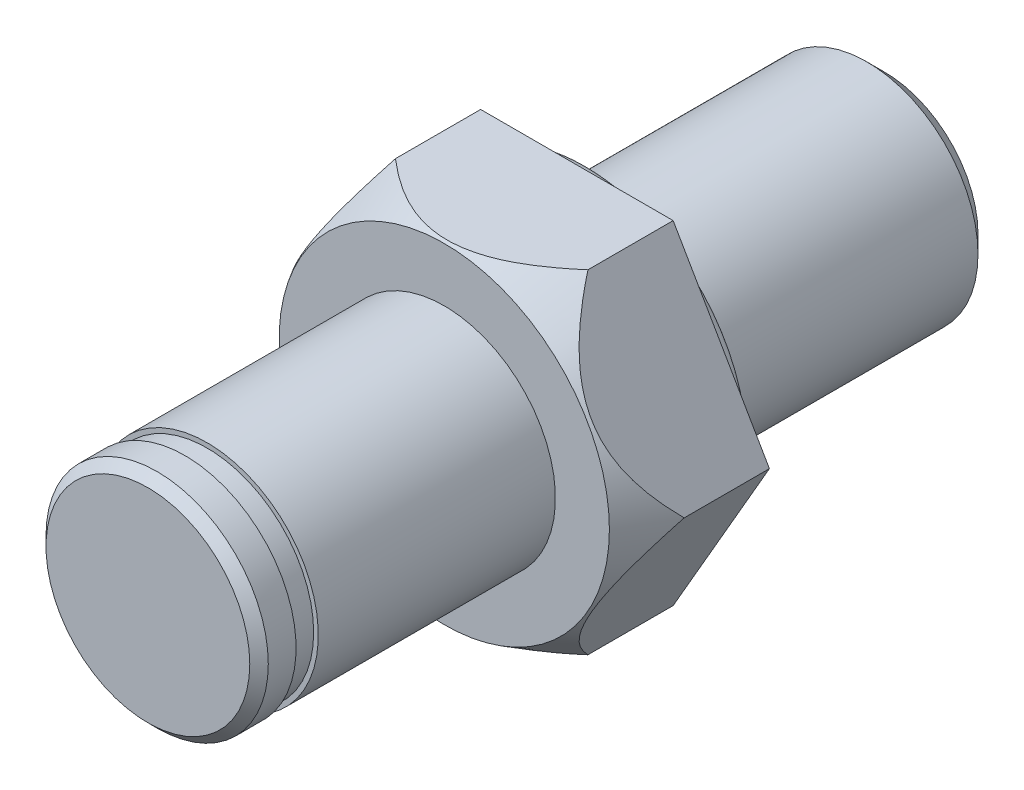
ISO-10303-21;
HEADER;
FILE_DESCRIPTION(('STEP AP214'),'2;1');
FILE_NAME('part.step','',(''),(''),'','','');
FILE_SCHEMA(('AUTOMOTIVE_DESIGN { 1 0 10303 214 1 1 1 1 }'));
ENDSEC;
DATA;
#1=APPLICATION_CONTEXT('core data for automotive mechanical design processes');
#2=APPLICATION_PROTOCOL_DEFINITION('international standard','automotive_design',2000,#1);
#3=PRODUCT_CONTEXT('',#1,'mechanical');
#4=PRODUCT('Part','Part','',(#3));
#5=PRODUCT_RELATED_PRODUCT_CATEGORY('part','',(#4));
#6=PRODUCT_DEFINITION_FORMATION('','',#4);
#7=PRODUCT_DEFINITION_CONTEXT('part definition',#1,'design');
#8=PRODUCT_DEFINITION('design','',#6,#7);
#9=PRODUCT_DEFINITION_SHAPE('','',#8);
#10=(LENGTH_UNIT() NAMED_UNIT(*) SI_UNIT(.MILLI.,.METRE.));
#11=(NAMED_UNIT(*) PLANE_ANGLE_UNIT() SI_UNIT($,.RADIAN.));
#12=(NAMED_UNIT(*) SI_UNIT($,.STERADIAN.) SOLID_ANGLE_UNIT());
#13=UNCERTAINTY_MEASURE_WITH_UNIT(LENGTH_MEASURE(1.E-05),#10,'distance_accuracy_value','');
#14=(GEOMETRIC_REPRESENTATION_CONTEXT(3) GLOBAL_UNCERTAINTY_ASSIGNED_CONTEXT((#13)) GLOBAL_UNIT_ASSIGNED_CONTEXT((#10,
#11,#12)) REPRESENTATION_CONTEXT('',''));
#15=CARTESIAN_POINT('',(0.,0.,0.));
#16=DIRECTION('',(0.,0.,1.));
#17=DIRECTION('',(1.,0.,0.));
#18=AXIS2_PLACEMENT_3D('',#15,#16,#17);
#19=CARTESIAN_POINT('',(0.,8.91428331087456,7.16));
#20=DIRECTION('',(0.,0.,-1.));
#21=DIRECTION('',(-1.,0.,0.));
#22=AXIS2_PLACEMENT_3D('',#19,#20,#21);
#23=PLANE('',#22);
#24=CARTESIAN_POINT('',(0.,0.,7.16));
#25=DIRECTION('',(0.,0.,1.));
#26=DIRECTION('',(1.,0.,0.));
#27=AXIS2_PLACEMENT_3D('',#24,#25,#26);
#28=CIRCLE('',#27,8.91428331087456);
#29=CARTESIAN_POINT('',(8.91428331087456,0.,7.16));
#30=VERTEX_POINT('',#29);
#31=EDGE_CURVE('E211',#30,#30,#28,.T.);
#32=ORIENTED_EDGE('',*,*,#31,.T.);
#33=EDGE_LOOP('',(#32));
#34=FACE_BOUND('',#33,.T.);
#35=CARTESIAN_POINT('',(0.,0.,7.16));
#36=DIRECTION('',(0.,0.,-1.));
#37=DIRECTION('',(-1.,0.,0.));
#38=AXIS2_PLACEMENT_3D('',#35,#36,#37);
#39=CIRCLE('',#38,6.);
#40=CARTESIAN_POINT('',(-6.,0.,7.16));
#41=VERTEX_POINT('',#40);
#42=EDGE_CURVE('E107',#41,#41,#39,.F.);
#43=ORIENTED_EDGE('',*,*,#42,.F.);
#44=EDGE_LOOP('',(#43));
#45=FACE_BOUND('',#44,.T.);
#46=ADVANCED_FACE('F36',(#34,#45),#23,.F.);
#47=CARTESIAN_POINT('',(0.,8.9,0.));
#48=DIRECTION('',(0.,0.,1.));
#49=DIRECTION('',(1.,0.,0.));
#50=AXIS2_PLACEMENT_3D('',#47,#48,#49);
#51=PLANE('',#50);
#52=CARTESIAN_POINT('',(0.,0.,0.));
#53=DIRECTION('',(0.,0.,1.));
#54=DIRECTION('',(1.,0.,0.));
#55=AXIS2_PLACEMENT_3D('',#52,#53,#54);
#56=CIRCLE('',#55,8.9);
#57=CARTESIAN_POINT('',(8.9,0.,0.));
#58=VERTEX_POINT('',#57);
#59=EDGE_CURVE('E215',#58,#58,#56,.T.);
#60=ORIENTED_EDGE('',*,*,#59,.T.);
#61=EDGE_LOOP('',(#60));
#62=FACE_BOUND('',#61,.T.);
#63=DIRECTION('',(-1.,0.,0.));
#64=VECTOR('',#63,1.);
#65=CARTESIAN_POINT('',(0.,-8.99999580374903,0.));
#66=LINE('',#65,#64);
#67=CARTESIAN_POINT('',(5.19615,-8.99999580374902,0.));
#68=VERTEX_POINT('',#67);
#69=CARTESIAN_POINT('',(-5.19615,-8.99999580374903,0.));
#70=VERTEX_POINT('',#69);
#71=EDGE_CURVE('E270',#68,#70,#66,.T.);
#72=ORIENTED_EDGE('',*,*,#71,.T.);
#73=DIRECTION('',(-0.5,0.866025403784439,0.));
#74=VECTOR('',#73,1.);
#75=CARTESIAN_POINT('',(-11.6480380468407,2.17500209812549,0.));
#76=LINE('',#75,#74);
#77=CARTESIAN_POINT('',(-10.3923,0.,0.));
#78=VERTEX_POINT('',#77);
#79=EDGE_CURVE('E99',#70,#78,#76,.T.);
#80=ORIENTED_EDGE('',*,*,#79,.T.);
#81=DIRECTION('',(0.5,0.866025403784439,0.));
#82=VECTOR('',#81,1.);
#83=CARTESIAN_POINT('',(-3.94041195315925,11.1749979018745,0.));
#84=LINE('',#83,#82);
#85=CARTESIAN_POINT('',(-5.19615,8.99999580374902,0.));
#86=VERTEX_POINT('',#85);
#87=EDGE_CURVE('E220',#78,#86,#84,.T.);
#88=ORIENTED_EDGE('',*,*,#87,.T.);
#89=DIRECTION('',(1.,0.,0.));
#90=VECTOR('',#89,1.);
#91=CARTESIAN_POINT('',(0.,8.99999580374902,0.));
#92=LINE('',#91,#90);
#93=CARTESIAN_POINT('',(5.19615,8.99999580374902,0.));
#94=VERTEX_POINT('',#93);
#95=EDGE_CURVE('E283',#86,#94,#92,.T.);
#96=ORIENTED_EDGE('',*,*,#95,.T.);
#97=DIRECTION('',(0.5,-0.866025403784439,0.));
#98=VECTOR('',#97,1.);
#99=CARTESIAN_POINT('',(3.94041195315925,11.1749979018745,0.));
#100=LINE('',#99,#98);
#101=CARTESIAN_POINT('',(10.3923,0.,0.));
#102=VERTEX_POINT('',#101);
#103=EDGE_CURVE('E276',#94,#102,#100,.T.);
#104=ORIENTED_EDGE('',*,*,#103,.T.);
#105=DIRECTION('',(-0.5,-0.866025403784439,0.));
#106=VECTOR('',#105,1.);
#107=CARTESIAN_POINT('',(11.6480380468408,2.1750020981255,0.));
#108=LINE('',#107,#106);
#109=EDGE_CURVE('E273',#102,#68,#108,.T.);
#110=ORIENTED_EDGE('',*,*,#109,.T.);
#111=EDGE_LOOP('',(#72,#80,#88,#96,#104,#110));
#112=FACE_BOUND('',#111,.T.);
#113=ADVANCED_FACE('F201',(#62,#112),#51,.F.);
#114=CARTESIAN_POINT('',(0.,0.,-16.6));
#115=DIRECTION('',(0.,0.,1.));
#116=DIRECTION('',(1.,0.,0.));
#117=AXIS2_PLACEMENT_3D('',#114,#115,#116);
#118=PLANE('',#117);
#119=CARTESIAN_POINT('',(0.,0.,-16.6));
#120=DIRECTION('',(0.,0.,1.));
#121=DIRECTION('',(1.,0.,0.));
#122=AXIS2_PLACEMENT_3D('',#119,#120,#121);
#123=CIRCLE('',#122,5.0528125);
#124=CARTESIAN_POINT('',(5.0528125,0.,-16.6));
#125=VERTEX_POINT('',#124);
#126=EDGE_CURVE('E91',#125,#125,#123,.T.);
#127=ORIENTED_EDGE('',*,*,#126,.F.);
#128=EDGE_LOOP('',(#127));
#129=FACE_BOUND('',#128,.T.);
#130=ADVANCED_FACE('F206',(#129),#118,.F.);
#131=CARTESIAN_POINT('',(0.,0.,-16.6));
#132=DIRECTION('',(0.,0.,1.));
#133=DIRECTION('',(1.,0.,0.));
#134=AXIS2_PLACEMENT_3D('',#131,#132,#133);
#135=CONICAL_SURFACE('',#134,5.0528125,0.78539816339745);
#136=CARTESIAN_POINT('',(0.,0.,-15.6528125));
#137=DIRECTION('',(0.,0.,1.));
#138=DIRECTION('',(1.,0.,0.));
#139=AXIS2_PLACEMENT_3D('',#136,#137,#138);
#140=CIRCLE('',#139,6.);
#141=CARTESIAN_POINT('',(6.,0.,-15.6528125));
#142=VERTEX_POINT('',#141);
#143=EDGE_CURVE('E232',#142,#142,#140,.T.);
#144=ORIENTED_EDGE('',*,*,#143,.F.);
#145=EDGE_LOOP('',(#144));
#146=FACE_BOUND('',#145,.T.);
#147=ORIENTED_EDGE('',*,*,#126,.T.);
#148=EDGE_LOOP('',(#147));
#149=FACE_BOUND('',#148,.T.);
#150=ADVANCED_FACE('F237',(#146,#149),#135,.T.);
#151=CARTESIAN_POINT('',(0.,0.,7.16));
#152=DIRECTION('',(0.,0.,1.));
#153=DIRECTION('',(1.,0.,0.));
#154=AXIS2_PLACEMENT_3D('',#151,#152,#153);
#155=CYLINDRICAL_SURFACE('',#154,6.);
#156=CARTESIAN_POINT('',(0.,0.,-1.2));
#157=DIRECTION('',(0.,0.,1.));
#158=DIRECTION('',(1.,0.,0.));
#159=AXIS2_PLACEMENT_3D('',#156,#157,#158);
#160=CIRCLE('',#159,6.);
#161=CARTESIAN_POINT('',(6.,0.,-1.2));
#162=VERTEX_POINT('',#161);
#163=EDGE_CURVE('E229',#162,#162,#160,.T.);
#164=ORIENTED_EDGE('',*,*,#163,.F.);
#165=EDGE_LOOP('',(#164));
#166=FACE_BOUND('',#165,.T.);
#167=ORIENTED_EDGE('',*,*,#143,.T.);
#168=EDGE_LOOP('',(#167));
#169=FACE_BOUND('',#168,.T.);
#170=ADVANCED_FACE('F243',(#166,#169),#155,.T.);
#171=CARTESIAN_POINT('',(0.,0.,-1.2));
#172=DIRECTION('',(0.,0.,1.));
#173=DIRECTION('',(1.,0.,0.));
#174=AXIS2_PLACEMENT_3D('',#171,#172,#173);
#175=TOROIDAL_SURFACE('',#174,6.6,0.6);
#176=ORIENTED_EDGE('',*,*,#163,.T.);
#177=EDGE_LOOP('',(#176));
#178=FACE_BOUND('',#177,.T.);
#179=CARTESIAN_POINT('',(0.,0.,-0.6));
#180=DIRECTION('',(0.,0.,1.));
#181=DIRECTION('',(1.,0.,0.));
#182=AXIS2_PLACEMENT_3D('',#179,#180,#181);
#183=CIRCLE('',#182,6.6);
#184=CARTESIAN_POINT('',(6.6,0.,-0.6));
#185=VERTEX_POINT('',#184);
#186=EDGE_CURVE('E226',#185,#185,#183,.T.);
#187=ORIENTED_EDGE('',*,*,#186,.F.);
#188=EDGE_LOOP('',(#187));
#189=FACE_BOUND('',#188,.T.);
#190=ADVANCED_FACE('F249',(#178,#189),#175,.F.);
#191=CARTESIAN_POINT('',(0.,6.6,-0.6));
#192=DIRECTION('',(0.,0.,1.));
#193=DIRECTION('',(1.,0.,0.));
#194=AXIS2_PLACEMENT_3D('',#191,#192,#193);
#195=PLANE('',#194);
#196=CARTESIAN_POINT('',(0.,0.,-0.6));
#197=DIRECTION('',(0.,0.,1.));
#198=DIRECTION('',(1.,0.,0.));
#199=AXIS2_PLACEMENT_3D('',#196,#197,#198);
#200=CIRCLE('',#199,8.3);
#201=CARTESIAN_POINT('',(8.3,0.,-0.599999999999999));
#202=VERTEX_POINT('',#201);
#203=EDGE_CURVE('E218',#202,#202,#200,.T.);
#204=ORIENTED_EDGE('',*,*,#203,.F.);
#205=EDGE_LOOP('',(#204));
#206=FACE_BOUND('',#205,.T.);
#207=ORIENTED_EDGE('',*,*,#186,.T.);
#208=EDGE_LOOP('',(#207));
#209=FACE_BOUND('',#208,.T.);
#210=ADVANCED_FACE('F253',(#206,#209),#195,.F.);
#211=CARTESIAN_POINT('',(0.,0.,0.));
#212=DIRECTION('',(0.,0.,1.));
#213=DIRECTION('',(1.,0.,0.));
#214=AXIS2_PLACEMENT_3D('',#211,#212,#213);
#215=TOROIDAL_SURFACE('',#214,8.3,0.6);
#216=ORIENTED_EDGE('',*,*,#59,.F.);
#217=EDGE_LOOP('',(#216));
#218=FACE_BOUND('',#217,.T.);
#219=ORIENTED_EDGE('',*,*,#203,.T.);
#220=EDGE_LOOP('',(#219));
#221=FACE_BOUND('',#220,.T.);
#222=ADVANCED_FACE('F130',(#218,#221),#215,.T.);
#223=CARTESIAN_POINT('',(-5.19615,-8.99999580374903,-16.6));
#224=DIRECTION('',(0.866025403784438,0.5,0.));
#225=DIRECTION('',(0.5,-0.866025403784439,0.));
#226=AXIS2_PLACEMENT_3D('',#223,#224,#225);
#227=PLANE('',#226);
#228=ORIENTED_EDGE('',*,*,#79,.F.);
#229=DIRECTION('',(0.,0.,1.));
#230=VECTOR('',#229,1.);
#231=CARTESIAN_POINT('',(-5.19615,-8.99999580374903,-16.6));
#232=LINE('',#231,#230);
#233=CARTESIAN_POINT('',(-5.19615,-8.99999580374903,4.6));
#234=VERTEX_POINT('',#233);
#235=EDGE_CURVE('E50',#70,#234,#232,.T.);
#236=ORIENTED_EDGE('',*,*,#235,.T.);
#237=CARTESIAN_POINT('',(-10.39230011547,1.99999999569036E-07,4.5999998));
#238=CARTESIAN_POINT('',(-10.3379521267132,-0.0941332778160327,4.69412363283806));
#239=CARTESIAN_POINT('',(-10.2830618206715,-0.189206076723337,4.78699190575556));
#240=CARTESIAN_POINT('',(-10.1720772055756,-0.381437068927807,4.96986731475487));
#241=CARTESIAN_POINT('',(-10.1159825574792,-0.478595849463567,5.05987362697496));
#242=CARTESIAN_POINT('',(-9.94518187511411,-0.774431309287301,5.32589489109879));
#243=CARTESIAN_POINT('',(-9.82851072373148,-0.976511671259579,5.49694520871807));
#244=CARTESIAN_POINT('',(-9.5860859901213,-1.39640362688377,5.82573328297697));
#245=CARTESIAN_POINT('',(-9.4601756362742,-1.61448675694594,5.98301295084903));
#246=CARTESIAN_POINT('',(-9.20153417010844,-2.06246691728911,6.27249878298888));
#247=CARTESIAN_POINT('',(-9.06881899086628,-2.29233635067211,6.40476039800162));
#248=CARTESIAN_POINT('',(-8.85847549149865,-2.6566619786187,6.58345675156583));
#249=CARTESIAN_POINT('',(-8.78330931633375,-2.78685361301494,6.64153424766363));
#250=CARTESIAN_POINT('',(-8.63100856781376,-3.05064624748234,6.74642897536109));
#251=CARTESIAN_POINT('',(-8.55387384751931,-3.18424750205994,6.7932453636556));
#252=CARTESIAN_POINT('',(-8.39855631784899,-3.45326535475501,6.87382819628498));
#253=CARTESIAN_POINT('',(-8.32038663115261,-3.58865922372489,6.90769496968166));
#254=CARTESIAN_POINT('',(-8.16287198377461,-3.86148259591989,6.96167569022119));
#255=CARTESIAN_POINT('',(-8.08352725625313,-3.99891169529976,6.98179232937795));
#256=CARTESIAN_POINT('',(-7.92350970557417,-4.27607022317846,7.0075890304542));
#257=CARTESIAN_POINT('',(-7.84283138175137,-4.41580917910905,7.01313434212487));
#258=CARTESIAN_POINT('',(-7.68156943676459,-4.69512306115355,7.00915939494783));
#259=CARTESIAN_POINT('',(-7.60098581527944,-4.83469798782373,6.99963918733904));
#260=CARTESIAN_POINT('',(-7.44040248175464,-5.11283648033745,6.96590132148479));
#261=CARTESIAN_POINT('',(-7.36040464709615,-5.25139679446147,6.94164826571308));
#262=CARTESIAN_POINT('',(-7.20176537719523,-5.52616807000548,6.8793913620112));
#263=CARTESIAN_POINT('',(-7.12312412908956,-5.6623787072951,6.84138563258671));
#264=CARTESIAN_POINT('',(-6.94513206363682,-5.97067000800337,6.74016812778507));
#265=CARTESIAN_POINT('',(-6.84636591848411,-6.14173798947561,6.67284588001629));
#266=CARTESIAN_POINT('',(-6.65225648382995,-6.47794539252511,6.52076849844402));
#267=CARTESIAN_POINT('',(-6.55691472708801,-6.64308215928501,6.43600566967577));
#268=CARTESIAN_POINT('',(-6.36939542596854,-6.96787511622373,6.25178053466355));
#269=CARTESIAN_POINT('',(-6.27723254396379,-7.12750591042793,6.1522590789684));
#270=CARTESIAN_POINT('',(-6.09637389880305,-7.44076227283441,5.94150534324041));
#271=CARTESIAN_POINT('',(-6.00767756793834,-7.59438882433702,5.83027499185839));
#272=CARTESIAN_POINT('',(-5.79297145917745,-7.9662707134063,5.54440153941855));
#273=CARTESIAN_POINT('',(-5.66877596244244,-8.18138362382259,5.36431048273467));
#274=CARTESIAN_POINT('',(-5.48760862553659,-8.49517465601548,5.08396563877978));
#275=CARTESIAN_POINT('',(-5.428394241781,-8.59773697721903,4.9893786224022));
#276=CARTESIAN_POINT('',(-5.31130338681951,-8.80054428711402,4.79699296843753));
#277=CARTESIAN_POINT('',(-5.25342664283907,-8.90078974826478,4.69919499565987));
#278=CARTESIAN_POINT('',(-5.19614988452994,-8.99999600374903,4.5999998));
#279=B_SPLINE_CURVE_WITH_KNOTS('',3,(#237,#238,#239,#240,#241,#242,#243,#244,#245,#246,#247,
#248,#249,#250,#251,#252,#253,#254,#255,#256,#257,#258,#259,#260,#261,#262,#263,#264,#265,#266,
#267,#268,#269,#270,#271,#272,#273,#274,#275,#276,#277,#278),.UNSPECIFIED.,.F.,.F.,(4,2,2,2,2,2,
2,2,2,2,2,2,2,2,2,2,2,2,2,2,4),(0.,0.431335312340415,0.862793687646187,1.73010571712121,
2.61982442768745,3.50754742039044,3.99066414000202,4.47381702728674,4.95314687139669,
5.43238284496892,5.91603526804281,6.39968604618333,6.88450347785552,7.36938726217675,
7.99443267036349,8.61975444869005,9.24765373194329,9.87544975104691,10.7949855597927,
11.249643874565,11.7042086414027),.UNSPECIFIED.);
#280=CARTESIAN_POINT('',(-10.3923,0.,4.6));
#281=VERTEX_POINT('',#280);
#282=EDGE_CURVE('E96',#281,#234,#279,.T.);
#283=ORIENTED_EDGE('',*,*,#282,.F.);
#284=DIRECTION('',(0.,0.,1.));
#285=VECTOR('',#284,1.);
#286=CARTESIAN_POINT('',(-10.3923,0.,-16.6));
#287=LINE('',#286,#285);
#288=EDGE_CURVE('E274',#78,#281,#287,.T.);
#289=ORIENTED_EDGE('',*,*,#288,.F.);
#290=EDGE_LOOP('',(#228,#236,#283,#289));
#291=FACE_BOUND('',#290,.T.);
#292=ADVANCED_FACE('F94',(#291),#227,.F.);
#293=CARTESIAN_POINT('',(-10.3923,0.,-16.6));
#294=DIRECTION('',(0.866025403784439,-0.5,0.));
#295=DIRECTION('',(-0.5,-0.866025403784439,0.));
#296=AXIS2_PLACEMENT_3D('',#293,#294,#295);
#297=PLANE('',#296);
#298=ORIENTED_EDGE('',*,*,#87,.F.);
#299=ORIENTED_EDGE('',*,*,#288,.T.);
#300=CARTESIAN_POINT('',(-5.19614988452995,8.99999600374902,4.5999998));
#301=CARTESIAN_POINT('',(-5.25049787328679,8.905862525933,4.69412363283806));
#302=CARTESIAN_POINT('',(-5.30538817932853,8.81078972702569,4.78699190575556));
#303=CARTESIAN_POINT('',(-5.41637279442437,8.61855873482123,4.96986731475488));
#304=CARTESIAN_POINT('',(-5.47246744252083,8.52139995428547,5.05987362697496));
#305=CARTESIAN_POINT('',(-5.6432681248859,8.22556449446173,5.32589489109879));
#306=CARTESIAN_POINT('',(-5.75993927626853,8.02348413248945,5.49694520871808));
#307=CARTESIAN_POINT('',(-6.00236400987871,7.60359217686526,5.82573328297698));
#308=CARTESIAN_POINT('',(-6.12827436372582,7.3855090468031,5.98301295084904));
#309=CARTESIAN_POINT('',(-6.38691582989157,6.93752888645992,6.27249878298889));
#310=CARTESIAN_POINT('',(-6.51963100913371,6.70765945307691,6.40476039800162));
#311=CARTESIAN_POINT('',(-6.72997450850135,6.34333382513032,6.58345675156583));
#312=CARTESIAN_POINT('',(-6.80514068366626,6.21314219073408,6.64153424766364));
#313=CARTESIAN_POINT('',(-6.95744143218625,5.94934955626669,6.74642897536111));
#314=CARTESIAN_POINT('',(-7.0345761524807,5.81574830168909,6.79324536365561));
#315=CARTESIAN_POINT('',(-7.18989368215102,5.54673044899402,6.87382819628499));
#316=CARTESIAN_POINT('',(-7.2680633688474,5.41133658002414,6.90769496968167));
#317=CARTESIAN_POINT('',(-7.4255780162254,5.13851320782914,6.96167569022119));
#318=CARTESIAN_POINT('',(-7.50492274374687,5.00108410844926,6.98179232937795));
#319=CARTESIAN_POINT('',(-7.66494029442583,4.72392558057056,7.0075890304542));
#320=CARTESIAN_POINT('',(-7.74561861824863,4.58418662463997,7.01313434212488));
#321=CARTESIAN_POINT('',(-7.90688056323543,4.30487274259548,7.00915939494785));
#322=CARTESIAN_POINT('',(-7.98746418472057,4.1652978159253,6.99963918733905));
#323=CARTESIAN_POINT('',(-8.14804751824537,3.88715932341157,6.9659013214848));
#324=CARTESIAN_POINT('',(-8.22804535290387,3.74859900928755,6.94164826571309));
#325=CARTESIAN_POINT('',(-8.38668462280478,3.47382773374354,6.8793913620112));
#326=CARTESIAN_POINT('',(-8.46532587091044,3.33761709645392,6.84138563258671));
#327=CARTESIAN_POINT('',(-8.64331793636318,3.02932579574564,6.74016812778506));
#328=CARTESIAN_POINT('',(-8.7420840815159,2.85825781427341,6.67284588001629));
#329=CARTESIAN_POINT('',(-8.93619351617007,2.52205041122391,6.52076849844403));
#330=CARTESIAN_POINT('',(-9.031535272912,2.35691364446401,6.43600566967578));
#331=CARTESIAN_POINT('',(-9.21905457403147,2.03212068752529,6.25178053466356));
#332=CARTESIAN_POINT('',(-9.31121745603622,1.87248989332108,6.15225907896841));
#333=CARTESIAN_POINT('',(-9.49207610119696,1.55923353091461,5.94150534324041));
#334=CARTESIAN_POINT('',(-9.58077243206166,1.405606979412,5.83027499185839));
#335=CARTESIAN_POINT('',(-9.79547854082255,1.03372509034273,5.54440153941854));
#336=CARTESIAN_POINT('',(-9.91967403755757,0.81861217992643,5.36431048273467));
#337=CARTESIAN_POINT('',(-10.1008413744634,0.504821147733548,5.0839656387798));
#338=CARTESIAN_POINT('',(-10.160055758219,0.402258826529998,4.98937862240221));
#339=CARTESIAN_POINT('',(-10.2771466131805,0.199451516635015,4.79699296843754));
#340=CARTESIAN_POINT('',(-10.3350233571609,0.0992060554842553,4.69919499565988));
#341=CARTESIAN_POINT('',(-10.39230011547,-1.99999997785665E-07,4.5999998));
#342=B_SPLINE_CURVE_WITH_KNOTS('',3,(#300,#301,#302,#303,#304,#305,#306,#307,#308,#309,#310,
#311,#312,#313,#314,#315,#316,#317,#318,#319,#320,#321,#322,#323,#324,#325,#326,#327,#328,#329,
#330,#331,#332,#333,#334,#335,#336,#337,#338,#339,#340,#341),.UNSPECIFIED.,.F.,.F.,(4,2,2,2,2,2,
2,2,2,2,2,2,2,2,2,2,2,2,2,2,4),(0.,0.431335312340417,0.862793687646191,1.73010571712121,
2.61982442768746,3.50754742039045,3.99066414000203,4.47381702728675,4.95314687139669,
5.43238284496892,5.91603526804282,6.39968604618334,6.88450347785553,7.36938726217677,
7.99443267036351,8.61975444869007,9.2476537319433,9.87544975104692,10.7949855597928,
11.249643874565,11.7042086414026),.UNSPECIFIED.);
#343=CARTESIAN_POINT('',(-5.19615,8.99999580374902,4.6));
#344=VERTEX_POINT('',#343);
#345=EDGE_CURVE('E106',#344,#281,#342,.T.);
#346=ORIENTED_EDGE('',*,*,#345,.F.);
#347=DIRECTION('',(0.,0.,1.));
#348=VECTOR('',#347,1.);
#349=CARTESIAN_POINT('',(-5.19615,8.99999580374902,-16.6));
#350=LINE('',#349,#348);
#351=EDGE_CURVE('E278',#86,#344,#350,.T.);
#352=ORIENTED_EDGE('',*,*,#351,.F.);
#353=EDGE_LOOP('',(#298,#299,#346,#352));
#354=FACE_BOUND('',#353,.T.);
#355=ADVANCED_FACE('F129',(#354),#297,.F.);
#356=CARTESIAN_POINT('',(-5.19615,8.99999580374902,-16.6));
#357=DIRECTION('',(0.,-1.,0.));
#358=DIRECTION('',(-1.,0.,0.));
#359=AXIS2_PLACEMENT_3D('',#356,#357,#358);
#360=PLANE('',#359);
#361=ORIENTED_EDGE('',*,*,#95,.F.);
#362=ORIENTED_EDGE('',*,*,#351,.T.);
#363=CARTESIAN_POINT('',(-8.98627235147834,8.99999580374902,0.571395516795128));
#364=CARTESIAN_POINT('',(-8.79996602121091,8.99999580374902,0.799349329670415));
#365=CARTESIAN_POINT('',(-8.61195702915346,8.99999580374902,1.02593259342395));
#366=CARTESIAN_POINT('',(-8.23187759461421,8.99999580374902,1.47576743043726));
#367=CARTESIAN_POINT('',(-8.03980607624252,8.99999580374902,1.69901809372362));
#368=CARTESIAN_POINT('',(-7.64923805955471,8.99999580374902,2.14353038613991));
#369=CARTESIAN_POINT('',(-7.45069843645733,8.99999580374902,2.36475424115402));
#370=CARTESIAN_POINT('',(-7.04814376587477,8.99999580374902,2.80213804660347));
#371=CARTESIAN_POINT('',(-6.8441292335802,8.99999580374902,3.01829846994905));
#372=CARTESIAN_POINT('',(-6.41641707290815,8.99999580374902,3.45798388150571));
#373=CARTESIAN_POINT('',(-6.19229454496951,8.99999580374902,3.68109742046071));
#374=CARTESIAN_POINT('',(-5.73528937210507,8.99999580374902,4.11833943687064));
#375=CARTESIAN_POINT('',(-5.50240454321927,8.99999580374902,4.33246564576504));
#376=CARTESIAN_POINT('',(-5.02714603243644,8.99999580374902,4.74808515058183));
#377=CARTESIAN_POINT('',(-4.78481251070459,8.99999580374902,4.94962408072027));
#378=CARTESIAN_POINT('',(-4.28796525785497,8.99999580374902,5.3369665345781));
#379=CARTESIAN_POINT('',(-4.03345989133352,8.99999580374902,5.5227806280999));
#380=CARTESIAN_POINT('',(-3.59930785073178,8.99999580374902,5.81341637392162));
#381=CARTESIAN_POINT('',(-3.42370260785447,8.99999580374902,5.92426179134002));
#382=CARTESIAN_POINT('',(-3.06567094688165,8.99999580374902,6.1345838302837));
#383=CARTESIAN_POINT('',(-2.88324236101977,8.99999580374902,6.23405679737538));
#384=CARTESIAN_POINT('',(-2.51312251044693,8.99999580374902,6.41809475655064));
#385=CARTESIAN_POINT('',(-2.32549800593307,8.99999580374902,6.50279284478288));
#386=CARTESIAN_POINT('',(-1.94354543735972,8.99999580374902,6.65544745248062));
#387=CARTESIAN_POINT('',(-1.74922042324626,8.99999580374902,6.72341147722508));
#388=CARTESIAN_POINT('',(-1.40560414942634,8.99999580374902,6.82455229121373));
#389=CARTESIAN_POINT('',(-1.25762116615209,8.99999580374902,6.86218026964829));
#390=CARTESIAN_POINT('',(-0.959092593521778,8.99999580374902,6.92537621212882));
#391=CARTESIAN_POINT('',(-0.808547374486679,8.99999580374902,6.95094590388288));
#392=CARTESIAN_POINT('',(-0.505849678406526,8.99999580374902,6.98912668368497));
#393=CARTESIAN_POINT('',(-0.353697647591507,8.99999580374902,7.0017412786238));
#394=CARTESIAN_POINT('',(-0.048864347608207,8.99999580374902,7.01354597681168));
#395=CARTESIAN_POINT('',(0.103816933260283,8.99999580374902,7.01273578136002));
#396=CARTESIAN_POINT('',(0.408453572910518,8.99999580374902,6.99772424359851));
#397=CARTESIAN_POINT('',(0.560409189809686,8.99999580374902,6.98352808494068));
#398=CARTESIAN_POINT('',(0.862548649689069,8.99999580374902,6.94228814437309));
#399=CARTESIAN_POINT('',(1.01273249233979,8.99999580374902,6.91524436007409));
#400=CARTESIAN_POINT('',(1.31053826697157,8.99999580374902,6.84921985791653));
#401=CARTESIAN_POINT('',(1.45815838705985,8.99999580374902,6.81023103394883));
#402=CARTESIAN_POINT('',(1.75011649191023,8.99999580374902,6.72150030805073));
#403=CARTESIAN_POINT('',(1.89445400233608,8.99999580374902,6.67175686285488));
#404=CARTESIAN_POINT('',(2.26405793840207,8.99999580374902,6.53043946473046));
#405=CARTESIAN_POINT('',(2.48653934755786,8.99999580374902,6.43155600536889));
#406=CARTESIAN_POINT('',(2.92191786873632,8.99999580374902,6.21457457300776));
#407=CARTESIAN_POINT('',(3.13480823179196,8.99999580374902,6.09646333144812));
#408=CARTESIAN_POINT('',(3.55374635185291,8.99999580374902,5.84379398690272));
#409=CARTESIAN_POINT('',(3.75969233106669,8.99999580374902,5.7090683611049));
#410=CARTESIAN_POINT('',(4.0621807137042,8.99999580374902,5.49799659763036));
#411=CARTESIAN_POINT('',(4.16192000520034,8.99999580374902,5.42615667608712));
#412=CARTESIAN_POINT('',(4.35940861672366,8.99999580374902,5.2797949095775));
#413=CARTESIAN_POINT('',(4.4571579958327,8.99999580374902,5.20527314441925));
#414=CARTESIAN_POINT('',(4.76615823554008,8.99999580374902,4.96364077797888));
#415=CARTESIAN_POINT('',(4.97387847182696,8.99999580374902,4.79200389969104));
#416=CARTESIAN_POINT('',(5.38164372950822,8.99999580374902,4.43980430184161));
#417=CARTESIAN_POINT('',(5.58168645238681,8.99999580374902,4.25923894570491));
#418=CARTESIAN_POINT('',(5.97535783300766,8.99999580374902,3.89084667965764));
#419=CARTESIAN_POINT('',(6.16897922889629,8.99999580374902,3.70301203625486));
#420=CARTESIAN_POINT('',(6.55048989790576,8.99999580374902,3.32166792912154));
#421=CARTESIAN_POINT('',(6.73837972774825,8.99999580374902,3.12815902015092));
#422=CARTESIAN_POINT('',(7.11029902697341,8.99999580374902,2.73536780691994));
#423=CARTESIAN_POINT('',(7.29430017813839,8.99999580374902,2.53605875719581));
#424=CARTESIAN_POINT('',(7.65799122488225,8.99999580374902,2.13353896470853));
#425=CARTESIAN_POINT('',(7.83768091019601,8.99999580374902,1.93032803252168));
#426=CARTESIAN_POINT('',(8.37092417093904,8.99999580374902,1.31608367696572));
#427=CARTESIAN_POINT('',(8.71888349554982,8.99999580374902,0.900190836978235));
#428=CARTESIAN_POINT('',(9.3688914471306,8.99999580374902,0.101376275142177));
#429=CARTESIAN_POINT('',(9.67203957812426,8.99999580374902,-0.280658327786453));
#430=CARTESIAN_POINT('',(10.2708728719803,8.99999580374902,-1.05062068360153));
#431=CARTESIAN_POINT('',(10.5665568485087,8.99999580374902,-1.43854935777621));
#432=CARTESIAN_POINT('',(11.1481470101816,8.99999580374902,-2.21414561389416));
#433=CARTESIAN_POINT('',(11.4341290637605,8.99999580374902,-2.60175644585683));
#434=CARTESIAN_POINT('',(11.8593297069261,8.99999580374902,-3.18582989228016));
#435=CARTESIAN_POINT('',(12.0004155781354,8.99999580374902,-3.38093718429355));
#436=CARTESIAN_POINT('',(12.2814438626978,8.99999580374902,-3.7719705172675));
#437=CARTESIAN_POINT('',(12.4213862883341,8.99999580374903,-3.96789654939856));
#438=CARTESIAN_POINT('',(12.560808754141,8.99999580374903,-4.16419197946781));
#439=B_SPLINE_CURVE_WITH_KNOTS('',3,(#363,#364,#365,#366,#367,#368,#369,#370,#371,#372,#373,
#374,#375,#376,#377,#378,#379,#380,#381,#382,#383,#384,#385,#386,#387,#388,#389,#390,#391,#392,
#393,#394,#395,#396,#397,#398,#399,#400,#401,#402,#403,#404,#405,#406,#407,#408,#409,#410,#411,
#412,#413,#414,#415,#416,#417,#418,#419,#420,#421,#422,#423,#424,#425,#426,#427,#428,#429,#430,
#431,#432,#433,#434,#435,#436,#437,#438),.UNSPECIFIED.,.F.,.F.,(4,2,2,2,2,2,2,2,2,2,2,2,2,2,2,2,
2,2,2,2,2,2,2,2,2,2,2,2,2,2,2,2,2,2,2,2,2,4),(0.,0.883224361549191,1.76668563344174,
2.65835836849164,3.54994748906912,4.49848347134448,5.44725745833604,6.39236385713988,
7.33682985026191,7.9594808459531,8.5823313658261,9.19924337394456,9.81587818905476,
10.2735113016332,10.7310788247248,11.188522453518,11.6459762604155,12.1032529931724,
12.5605298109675,13.0181176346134,13.4757711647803,14.2049132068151,14.9345605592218,
15.6722814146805,16.0410012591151,16.4097101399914,17.2177219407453,18.0259737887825,
18.8351105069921,19.6441683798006,20.4578661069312,21.2716034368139,22.898061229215,
24.3610569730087,25.8242837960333,27.2693135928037,27.9916319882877,28.7139426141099),.UNSPECIFIED.);
#440=CARTESIAN_POINT('',(5.19615,8.99999580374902,4.6));
#441=VERTEX_POINT('',#440);
#442=EDGE_CURVE('E111',#441,#344,#439,.F.);
#443=ORIENTED_EDGE('',*,*,#442,.F.);
#444=DIRECTION('',(0.,0.,1.));
#445=VECTOR('',#444,1.);
#446=CARTESIAN_POINT('',(5.19615,8.99999580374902,-16.6));
#447=LINE('',#446,#445);
#448=EDGE_CURVE('E287',#94,#441,#447,.T.);
#449=ORIENTED_EDGE('',*,*,#448,.F.);
#450=EDGE_LOOP('',(#361,#362,#443,#449));
#451=FACE_BOUND('',#450,.T.);
#452=ADVANCED_FACE('F134',(#451),#360,.F.);
#453=CARTESIAN_POINT('',(5.19615,8.99999580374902,-16.6));
#454=DIRECTION('',(-0.866025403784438,-0.5,0.));
#455=DIRECTION('',(-0.5,0.866025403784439,0.));
#456=AXIS2_PLACEMENT_3D('',#453,#454,#455);
#457=PLANE('',#456);
#458=ORIENTED_EDGE('',*,*,#103,.F.);
#459=ORIENTED_EDGE('',*,*,#448,.T.);
#460=CARTESIAN_POINT('',(10.39230011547,-1.99999993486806E-07,4.5999998));
#461=CARTESIAN_POINT('',(10.3379521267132,0.094133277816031,4.69412363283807));
#462=CARTESIAN_POINT('',(10.2830618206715,0.189206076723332,4.78699190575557));
#463=CARTESIAN_POINT('',(10.1720772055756,0.381437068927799,4.96986731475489));
#464=CARTESIAN_POINT('',(10.1159825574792,0.47859584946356,5.05987362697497));
#465=CARTESIAN_POINT('',(9.94518187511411,0.774431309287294,5.3258948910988));
#466=CARTESIAN_POINT('',(9.82851072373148,0.976511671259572,5.49694520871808));
#467=CARTESIAN_POINT('',(9.58608599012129,1.39640362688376,5.82573328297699));
#468=CARTESIAN_POINT('',(9.46017563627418,1.61448675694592,5.98301295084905));
#469=CARTESIAN_POINT('',(9.20153417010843,2.06246691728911,6.27249878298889));
#470=CARTESIAN_POINT('',(9.06881899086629,2.29233635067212,6.40476039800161));
#471=CARTESIAN_POINT('',(8.85847549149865,2.65666197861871,6.58345675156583));
#472=CARTESIAN_POINT('',(8.78330931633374,2.78685361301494,6.64153424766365));
#473=CARTESIAN_POINT('',(8.63100856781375,3.05064624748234,6.74642897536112));
#474=CARTESIAN_POINT('',(8.5538738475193,3.18424750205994,6.79324536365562));
#475=CARTESIAN_POINT('',(8.39855631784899,3.45326535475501,6.873828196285));
#476=CARTESIAN_POINT('',(8.3203866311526,3.58865922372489,6.90769496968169));
#477=CARTESIAN_POINT('',(8.1628719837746,3.86148259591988,6.9616756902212));
#478=CARTESIAN_POINT('',(8.08352725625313,3.99891169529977,6.98179232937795));
#479=CARTESIAN_POINT('',(7.92350970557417,4.27607022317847,7.0075890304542));
#480=CARTESIAN_POINT('',(7.84283138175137,4.41580917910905,7.01313434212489));
#481=CARTESIAN_POINT('',(7.68156943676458,4.69512306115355,7.00915939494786));
#482=CARTESIAN_POINT('',(7.60098581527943,4.83469798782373,6.99963918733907));
#483=CARTESIAN_POINT('',(7.44040248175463,5.11283648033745,6.96590132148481));
#484=CARTESIAN_POINT('',(7.36040464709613,5.25139679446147,6.9416482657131));
#485=CARTESIAN_POINT('',(7.20176537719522,5.52616807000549,6.87939136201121));
#486=CARTESIAN_POINT('',(7.12312412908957,5.66237870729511,6.84138563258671));
#487=CARTESIAN_POINT('',(6.94513206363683,5.97067000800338,6.74016812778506));
#488=CARTESIAN_POINT('',(6.8463659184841,6.14173798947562,6.6728458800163));
#489=CARTESIAN_POINT('',(6.65225648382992,6.47794539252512,6.52076849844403));
#490=CARTESIAN_POINT('',(6.556914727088,6.64308215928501,6.43600566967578));
#491=CARTESIAN_POINT('',(6.36939542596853,6.96787511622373,6.25178053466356));
#492=CARTESIAN_POINT('',(6.27723254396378,7.12750591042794,6.15225907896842));
#493=CARTESIAN_POINT('',(6.09637389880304,7.44076227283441,5.94150534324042));
#494=CARTESIAN_POINT('',(6.00767756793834,7.59438882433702,5.83027499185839));
#495=CARTESIAN_POINT('',(5.79297145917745,7.96627071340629,5.54440153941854));
#496=CARTESIAN_POINT('',(5.66877596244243,8.18138362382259,5.36431048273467));
#497=CARTESIAN_POINT('',(5.48760862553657,8.49517465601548,5.0839656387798));
#498=CARTESIAN_POINT('',(5.42839424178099,8.59773697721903,4.98937862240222));
#499=CARTESIAN_POINT('',(5.3113033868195,8.80054428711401,4.79699296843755));
#500=CARTESIAN_POINT('',(5.25342664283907,8.90078974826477,4.69919499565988));
#501=CARTESIAN_POINT('',(5.19614988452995,8.99999600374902,4.5999998));
#502=B_SPLINE_CURVE_WITH_KNOTS('',3,(#460,#461,#462,#463,#464,#465,#466,#467,#468,#469,#470,
#471,#472,#473,#474,#475,#476,#477,#478,#479,#480,#481,#482,#483,#484,#485,#486,#487,#488,#489,
#490,#491,#492,#493,#494,#495,#496,#497,#498,#499,#500,#501),.UNSPECIFIED.,.F.,.F.,(4,2,2,2,2,2,
2,2,2,2,2,2,2,2,2,2,2,2,2,2,4),(0.,0.431335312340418,0.862793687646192,1.73010571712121,
2.61982442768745,3.50754742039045,3.99066414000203,4.47381702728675,4.95314687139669,
5.43238284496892,5.91603526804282,6.39968604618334,6.88450347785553,7.36938726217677,
7.99443267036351,8.61975444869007,9.2476537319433,9.87544975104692,10.7949855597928,
11.249643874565,11.7042086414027),.UNSPECIFIED.);
#503=CARTESIAN_POINT('',(10.3923,0.,4.6));
#504=VERTEX_POINT('',#503);
#505=EDGE_CURVE('E148',#504,#441,#502,.T.);
#506=ORIENTED_EDGE('',*,*,#505,.F.);
#507=DIRECTION('',(0.,0.,1.));
#508=VECTOR('',#507,1.);
#509=CARTESIAN_POINT('',(10.3923,0.,-16.6));
#510=LINE('',#509,#508);
#511=EDGE_CURVE('E289',#102,#504,#510,.T.);
#512=ORIENTED_EDGE('',*,*,#511,.F.);
#513=EDGE_LOOP('',(#458,#459,#506,#512));
#514=FACE_BOUND('',#513,.T.);
#515=ADVANCED_FACE('F139',(#514),#457,.F.);
#516=CARTESIAN_POINT('',(10.3923,0.,-16.6));
#517=DIRECTION('',(-0.866025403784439,0.5,0.));
#518=DIRECTION('',(0.5,0.866025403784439,0.));
#519=AXIS2_PLACEMENT_3D('',#516,#517,#518);
#520=PLANE('',#519);
#521=ORIENTED_EDGE('',*,*,#109,.F.);
#522=ORIENTED_EDGE('',*,*,#511,.T.);
#523=CARTESIAN_POINT('',(5.19614988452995,-8.99999600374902,4.5999998));
#524=CARTESIAN_POINT('',(5.25049787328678,-8.905862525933,4.69412363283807));
#525=CARTESIAN_POINT('',(5.30538817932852,-8.81078972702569,4.78699190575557));
#526=CARTESIAN_POINT('',(5.41637279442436,-8.61855873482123,4.96986731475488));
#527=CARTESIAN_POINT('',(5.47246744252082,-8.52139995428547,5.05987362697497));
#528=CARTESIAN_POINT('',(5.64326812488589,-8.22556449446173,5.3258948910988));
#529=CARTESIAN_POINT('',(5.75993927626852,-8.02348413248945,5.49694520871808));
#530=CARTESIAN_POINT('',(6.0023640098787,-7.60359217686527,5.82573328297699));
#531=CARTESIAN_POINT('',(6.12827436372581,-7.3855090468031,5.98301295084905));
#532=CARTESIAN_POINT('',(6.38691582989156,-6.93752888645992,6.27249878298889));
#533=CARTESIAN_POINT('',(6.51963100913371,-6.70765945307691,6.40476039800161));
#534=CARTESIAN_POINT('',(6.72997450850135,-6.34333382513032,6.58345675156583));
#535=CARTESIAN_POINT('',(6.80514068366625,-6.21314219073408,6.64153424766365));
#536=CARTESIAN_POINT('',(6.95744143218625,-5.94934955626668,6.74642897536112));
#537=CARTESIAN_POINT('',(7.03457615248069,-5.81574830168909,6.79324536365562));
#538=CARTESIAN_POINT('',(7.18989368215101,-5.54673044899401,6.873828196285));
#539=CARTESIAN_POINT('',(7.26806336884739,-5.41133658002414,6.90769496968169));
#540=CARTESIAN_POINT('',(7.4255780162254,-5.13851320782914,6.96167569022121));
#541=CARTESIAN_POINT('',(7.50492274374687,-5.00108410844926,6.98179232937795));
#542=CARTESIAN_POINT('',(7.66494029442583,-4.72392558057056,7.0075890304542));
#543=CARTESIAN_POINT('',(7.74561861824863,-4.58418662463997,7.01313434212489));
#544=CARTESIAN_POINT('',(7.90688056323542,-4.30487274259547,7.00915939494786));
#545=CARTESIAN_POINT('',(7.98746418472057,-4.1652978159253,6.99963918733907));
#546=CARTESIAN_POINT('',(8.14804751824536,-3.88715932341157,6.96590132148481));
#547=CARTESIAN_POINT('',(8.22804535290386,-3.74859900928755,6.9416482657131));
#548=CARTESIAN_POINT('',(8.38668462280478,-3.47382773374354,6.87939136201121));
#549=CARTESIAN_POINT('',(8.46532587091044,-3.33761709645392,6.84138563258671));
#550=CARTESIAN_POINT('',(8.64331793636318,-3.02932579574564,6.74016812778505));
#551=CARTESIAN_POINT('',(8.7420840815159,-2.8582578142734,6.67284588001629));
#552=CARTESIAN_POINT('',(8.93619351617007,-2.5220504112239,6.52076849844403));
#553=CARTESIAN_POINT('',(9.031535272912,-2.356913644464,6.43600566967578));
#554=CARTESIAN_POINT('',(9.21905457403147,-2.03212068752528,6.25178053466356));
#555=CARTESIAN_POINT('',(9.31121745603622,-1.87248989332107,6.15225907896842));
#556=CARTESIAN_POINT('',(9.49207610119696,-1.5592335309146,5.94150534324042));
#557=CARTESIAN_POINT('',(9.58077243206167,-1.40560697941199,5.83027499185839));
#558=CARTESIAN_POINT('',(9.79547854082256,-1.03372509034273,5.54440153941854));
#559=CARTESIAN_POINT('',(9.91967403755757,-0.818612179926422,5.36431048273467));
#560=CARTESIAN_POINT('',(10.1008413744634,-0.504821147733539,5.0839656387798));
#561=CARTESIAN_POINT('',(10.160055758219,-0.402258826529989,4.98937862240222));
#562=CARTESIAN_POINT('',(10.2771466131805,-0.199451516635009,4.79699296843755));
#563=CARTESIAN_POINT('',(10.3350233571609,-0.0992060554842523,4.69919499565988));
#564=CARTESIAN_POINT('',(10.39230011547,1.99999997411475E-07,4.5999998));
#565=B_SPLINE_CURVE_WITH_KNOTS('',3,(#523,#524,#525,#526,#527,#528,#529,#530,#531,#532,#533,
#534,#535,#536,#537,#538,#539,#540,#541,#542,#543,#544,#545,#546,#547,#548,#549,#550,#551,#552,
#553,#554,#555,#556,#557,#558,#559,#560,#561,#562,#563,#564),.UNSPECIFIED.,.F.,.F.,(4,2,2,2,2,2,
2,2,2,2,2,2,2,2,2,2,2,2,2,2,4),(0.,0.431335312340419,0.862793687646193,1.73010571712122,
2.61982442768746,3.50754742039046,3.99066414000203,4.47381702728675,4.9531468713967,
5.43238284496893,5.91603526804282,6.39968604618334,6.88450347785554,7.36938726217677,
7.99443267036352,8.61975444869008,9.24765373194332,9.87544975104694,10.7949855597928,
11.249643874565,11.7042086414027),.UNSPECIFIED.);
#566=CARTESIAN_POINT('',(5.19615,-8.99999580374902,4.6));
#567=VERTEX_POINT('',#566);
#568=EDGE_CURVE('E90',#567,#504,#565,.T.);
#569=ORIENTED_EDGE('',*,*,#568,.F.);
#570=DIRECTION('',(0.,0.,1.));
#571=VECTOR('',#570,1.);
#572=CARTESIAN_POINT('',(5.19615,-8.99999580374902,-16.6));
#573=LINE('',#572,#571);
#574=EDGE_CURVE('E55',#68,#567,#573,.T.);
#575=ORIENTED_EDGE('',*,*,#574,.F.);
#576=EDGE_LOOP('',(#521,#522,#569,#575));
#577=FACE_BOUND('',#576,.T.);
#578=ADVANCED_FACE('F165',(#577),#520,.F.);
#579=CARTESIAN_POINT('',(5.19615,-8.99999580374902,-16.6));
#580=DIRECTION('',(0.,1.,0.));
#581=DIRECTION('',(1.,0.,0.));
#582=AXIS2_PLACEMENT_3D('',#579,#580,#581);
#583=PLANE('',#582);
#584=ORIENTED_EDGE('',*,*,#71,.F.);
#585=ORIENTED_EDGE('',*,*,#574,.T.);
#586=CARTESIAN_POINT('',(-8.98627235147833,-8.99999580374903,0.571395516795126));
#587=CARTESIAN_POINT('',(-8.7999660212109,-8.99999580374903,0.799349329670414));
#588=CARTESIAN_POINT('',(-8.61195702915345,-8.99999580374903,1.02593259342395));
#589=CARTESIAN_POINT('',(-8.2318775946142,-8.99999580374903,1.47576743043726));
#590=CARTESIAN_POINT('',(-8.03980607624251,-8.99999580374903,1.69901809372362));
#591=CARTESIAN_POINT('',(-7.6492380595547,-8.99999580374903,2.14353038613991));
#592=CARTESIAN_POINT('',(-7.45069843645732,-8.99999580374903,2.36475424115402));
#593=CARTESIAN_POINT('',(-7.04814376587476,-8.99999580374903,2.80213804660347));
#594=CARTESIAN_POINT('',(-6.84412923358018,-8.99999580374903,3.01829846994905));
#595=CARTESIAN_POINT('',(-6.41641707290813,-8.99999580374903,3.45798388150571));
#596=CARTESIAN_POINT('',(-6.1922945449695,-8.99999580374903,3.68109742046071));
#597=CARTESIAN_POINT('',(-5.73528937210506,-8.99999580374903,4.11833943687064));
#598=CARTESIAN_POINT('',(-5.50240454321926,-8.99999580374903,4.33246564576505));
#599=CARTESIAN_POINT('',(-5.02714603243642,-8.99999580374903,4.74808515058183));
#600=CARTESIAN_POINT('',(-4.78481251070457,-8.99999580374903,4.94962408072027));
#601=CARTESIAN_POINT('',(-4.28796525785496,-8.99999580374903,5.3369665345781));
#602=CARTESIAN_POINT('',(-4.03345989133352,-8.99999580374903,5.5227806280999));
#603=CARTESIAN_POINT('',(-3.59930785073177,-8.99999580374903,5.81341637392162));
#604=CARTESIAN_POINT('',(-3.42370260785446,-8.99999580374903,5.92426179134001));
#605=CARTESIAN_POINT('',(-3.06567094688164,-8.99999580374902,6.1345838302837));
#606=CARTESIAN_POINT('',(-2.88324236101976,-8.99999580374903,6.23405679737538));
#607=CARTESIAN_POINT('',(-2.51312251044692,-8.99999580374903,6.41809475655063));
#608=CARTESIAN_POINT('',(-2.32549800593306,-8.99999580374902,6.50279284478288));
#609=CARTESIAN_POINT('',(-1.94354543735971,-8.99999580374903,6.65544745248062));
#610=CARTESIAN_POINT('',(-1.74922042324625,-8.99999580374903,6.72341147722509));
#611=CARTESIAN_POINT('',(-1.40560414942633,-8.99999580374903,6.82455229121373));
#612=CARTESIAN_POINT('',(-1.25762116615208,-8.99999580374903,6.86218026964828));
#613=CARTESIAN_POINT('',(-0.959092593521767,-8.99999580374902,6.92537621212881));
#614=CARTESIAN_POINT('',(-0.808547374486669,-8.99999580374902,6.95094590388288));
#615=CARTESIAN_POINT('',(-0.505849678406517,-8.99999580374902,6.98912668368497));
#616=CARTESIAN_POINT('',(-0.353697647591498,-8.99999580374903,7.0017412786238));
#617=CARTESIAN_POINT('',(-0.048864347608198,-8.99999580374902,7.01354597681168));
#618=CARTESIAN_POINT('',(0.103816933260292,-8.99999580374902,7.01273578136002));
#619=CARTESIAN_POINT('',(0.408453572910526,-8.99999580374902,6.99772424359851));
#620=CARTESIAN_POINT('',(0.560409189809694,-8.99999580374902,6.98352808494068));
#621=CARTESIAN_POINT('',(0.862548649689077,-8.99999580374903,6.94228814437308));
#622=CARTESIAN_POINT('',(1.0127324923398,-8.99999580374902,6.91524436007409));
#623=CARTESIAN_POINT('',(1.31053826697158,-8.99999580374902,6.84921985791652));
#624=CARTESIAN_POINT('',(1.45815838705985,-8.99999580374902,6.81023103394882));
#625=CARTESIAN_POINT('',(1.75011649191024,-8.99999580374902,6.72150030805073));
#626=CARTESIAN_POINT('',(1.89445400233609,-8.99999580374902,6.67175686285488));
#627=CARTESIAN_POINT('',(2.26405793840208,-8.99999580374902,6.53043946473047));
#628=CARTESIAN_POINT('',(2.48653934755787,-8.99999580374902,6.43155600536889));
#629=CARTESIAN_POINT('',(2.92191786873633,-8.99999580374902,6.21457457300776));
#630=CARTESIAN_POINT('',(3.13480823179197,-8.99999580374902,6.09646333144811));
#631=CARTESIAN_POINT('',(3.55374635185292,-8.99999580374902,5.84379398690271));
#632=CARTESIAN_POINT('',(3.75969233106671,-8.99999580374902,5.70906836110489));
#633=CARTESIAN_POINT('',(4.06218071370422,-8.99999580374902,5.49799659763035));
#634=CARTESIAN_POINT('',(4.16192000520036,-8.99999580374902,5.42615667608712));
#635=CARTESIAN_POINT('',(4.35940861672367,-8.99999580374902,5.2797949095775));
#636=CARTESIAN_POINT('',(4.45715799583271,-8.99999580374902,5.20527314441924));
#637=CARTESIAN_POINT('',(4.76615823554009,-8.99999580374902,4.96364077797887));
#638=CARTESIAN_POINT('',(4.97387847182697,-8.99999580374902,4.79200389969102));
#639=CARTESIAN_POINT('',(5.38164372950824,-8.99999580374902,4.4398043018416));
#640=CARTESIAN_POINT('',(5.58168645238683,-8.99999580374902,4.2592389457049));
#641=CARTESIAN_POINT('',(5.97535783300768,-8.99999580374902,3.89084667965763));
#642=CARTESIAN_POINT('',(6.16897922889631,-8.99999580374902,3.70301203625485));
#643=CARTESIAN_POINT('',(6.55048989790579,-8.99999580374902,3.32166792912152));
#644=CARTESIAN_POINT('',(6.73837972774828,-8.99999580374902,3.1281590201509));
#645=CARTESIAN_POINT('',(7.11029902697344,-8.99999580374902,2.73536780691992));
#646=CARTESIAN_POINT('',(7.29430017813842,-8.99999580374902,2.53605875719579));
#647=CARTESIAN_POINT('',(7.65799122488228,-8.99999580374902,2.1335389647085));
#648=CARTESIAN_POINT('',(7.83768091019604,-8.99999580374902,1.93032803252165));
#649=CARTESIAN_POINT('',(8.37092417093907,-8.99999580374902,1.31608367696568));
#650=CARTESIAN_POINT('',(8.71888349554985,-8.99999580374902,0.900190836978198));
#651=CARTESIAN_POINT('',(9.36889144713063,-8.99999580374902,0.101376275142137));
#652=CARTESIAN_POINT('',(9.67203957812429,-8.99999580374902,-0.280658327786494));
#653=CARTESIAN_POINT('',(10.2708728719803,-8.99999580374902,-1.05062068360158));
#654=CARTESIAN_POINT('',(10.5665568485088,-8.99999580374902,-1.43854935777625));
#655=CARTESIAN_POINT('',(11.1481470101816,-8.99999580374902,-2.2141456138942));
#656=CARTESIAN_POINT('',(11.4341290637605,-8.99999580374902,-2.60175644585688));
#657=CARTESIAN_POINT('',(11.8593297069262,-8.99999580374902,-3.18582989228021));
#658=CARTESIAN_POINT('',(12.0004155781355,-8.99999580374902,-3.38093718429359));
#659=CARTESIAN_POINT('',(12.2814438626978,-8.99999580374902,-3.77197051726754));
#660=CARTESIAN_POINT('',(12.4213862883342,-8.99999580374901,-3.9678965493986));
#661=CARTESIAN_POINT('',(12.560808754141,-8.99999580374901,-4.16419197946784));
#662=B_SPLINE_CURVE_WITH_KNOTS('',3,(#586,#587,#588,#589,#590,#591,#592,#593,#594,#595,#596,
#597,#598,#599,#600,#601,#602,#603,#604,#605,#606,#607,#608,#609,#610,#611,#612,#613,#614,#615,
#616,#617,#618,#619,#620,#621,#622,#623,#624,#625,#626,#627,#628,#629,#630,#631,#632,#633,#634,
#635,#636,#637,#638,#639,#640,#641,#642,#643,#644,#645,#646,#647,#648,#649,#650,#651,#652,#653,
#654,#655,#656,#657,#658,#659,#660,#661),.UNSPECIFIED.,.F.,.F.,(4,2,2,2,2,2,2,2,2,2,2,2,2,2,2,2,
2,2,2,2,2,2,2,2,2,2,2,2,2,2,2,2,2,2,2,2,2,4),(0.,0.88322436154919,1.76668563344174,
2.65835836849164,3.54994748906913,4.49848347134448,5.44725745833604,6.39236385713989,
7.33682985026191,7.9594808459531,8.5823313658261,9.19924337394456,9.81587818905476,
10.2735113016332,10.7310788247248,11.188522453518,11.6459762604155,12.1032529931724,
12.5605298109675,13.0181176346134,13.4757711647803,14.2049132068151,14.9345605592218,
15.6722814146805,16.0410012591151,16.4097101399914,17.2177219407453,18.0259737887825,
18.8351105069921,19.6441683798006,20.4578661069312,21.2716034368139,22.898061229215,
24.3610569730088,25.8242837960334,27.2693135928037,27.9916319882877,28.7139426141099),.UNSPECIFIED.);
#663=EDGE_CURVE('E85',#234,#567,#662,.T.);
#664=ORIENTED_EDGE('',*,*,#663,.F.);
#665=ORIENTED_EDGE('',*,*,#235,.F.);
#666=EDGE_LOOP('',(#584,#585,#664,#665));
#667=FACE_BOUND('',#666,.T.);
#668=ADVANCED_FACE('F86',(#667),#583,.F.);
#669=CARTESIAN_POINT('',(0.,0.,4.6));
#670=DIRECTION('',(0.,0.,-1.));
#671=DIRECTION('',(-1.,0.,0.));
#672=AXIS2_PLACEMENT_3D('',#669,#670,#671);
#673=CONICAL_SURFACE('',#672,10.3923,0.523598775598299);
#674=ORIENTED_EDGE('',*,*,#31,.F.);
#675=EDGE_LOOP('',(#674));
#676=FACE_BOUND('',#675,.T.);
#677=ORIENTED_EDGE('',*,*,#345,.T.);
#678=ORIENTED_EDGE('',*,*,#282,.T.);
#679=ORIENTED_EDGE('',*,*,#663,.T.);
#680=ORIENTED_EDGE('',*,*,#568,.T.);
#681=ORIENTED_EDGE('',*,*,#505,.T.);
#682=ORIENTED_EDGE('',*,*,#442,.T.);
#683=EDGE_LOOP('',(#677,#678,#679,#680,#681,#682));
#684=FACE_BOUND('',#683,.T.);
#685=ADVANCED_FACE('F104',(#676,#684),#673,.T.);
#686=CARTESIAN_POINT('',(0.,0.,23.16));
#687=DIRECTION('',(0.,0.,-1.));
#688=DIRECTION('',(-1.,0.,0.));
#689=AXIS2_PLACEMENT_3D('',#686,#687,#688);
#690=CYLINDRICAL_SURFACE('',#689,6.);
#691=CARTESIAN_POINT('',(0.,0.,19.96));
#692=DIRECTION('',(0.,0.,-1.));
#693=DIRECTION('',(-1.,0.,0.));
#694=AXIS2_PLACEMENT_3D('',#691,#692,#693);
#695=CIRCLE('',#694,6.);
#696=CARTESIAN_POINT('',(-6.,0.,19.96));
#697=VERTEX_POINT('',#696);
#698=EDGE_CURVE('E303',#697,#697,#695,.T.);
#699=ORIENTED_EDGE('',*,*,#698,.T.);
#700=EDGE_LOOP('',(#699));
#701=FACE_BOUND('',#700,.T.);
#702=ORIENTED_EDGE('',*,*,#42,.T.);
#703=EDGE_LOOP('',(#702));
#704=FACE_BOUND('',#703,.T.);
#705=ADVANCED_FACE('F172',(#701,#704),#690,.T.);
#706=CARTESIAN_POINT('',(0.,6.,21.16));
#707=DIRECTION('',(0.,0.,1.));
#708=DIRECTION('',(1.,0.,0.));
#709=AXIS2_PLACEMENT_3D('',#706,#707,#708);
#710=PLANE('',#709);
#711=CARTESIAN_POINT('',(0.,0.,21.16));
#712=DIRECTION('',(0.,0.,-1.));
#713=DIRECTION('',(-1.,0.,0.));
#714=AXIS2_PLACEMENT_3D('',#711,#712,#713);
#715=CIRCLE('',#714,5.75);
#716=CARTESIAN_POINT('',(-5.75,0.,21.16));
#717=VERTEX_POINT('',#716);
#718=EDGE_CURVE('E297',#717,#717,#715,.T.);
#719=ORIENTED_EDGE('',*,*,#718,.F.);
#720=EDGE_LOOP('',(#719));
#721=FACE_BOUND('',#720,.T.);
#722=CARTESIAN_POINT('',(0.,0.,21.16));
#723=DIRECTION('',(0.,0.,-1.));
#724=DIRECTION('',(-1.,0.,0.));
#725=AXIS2_PLACEMENT_3D('',#722,#723,#724);
#726=CIRCLE('',#725,6.);
#727=CARTESIAN_POINT('',(-6.,0.,21.16));
#728=VERTEX_POINT('',#727);
#729=EDGE_CURVE('E101',#728,#728,#726,.T.);
#730=ORIENTED_EDGE('',*,*,#729,.T.);
#731=EDGE_LOOP('',(#730));
#732=FACE_BOUND('',#731,.T.);
#733=ADVANCED_FACE('F175',(#721,#732),#710,.F.);
#734=CARTESIAN_POINT('',(0.,0.,0.));
#735=DIRECTION('',(0.,0.,-1.));
#736=DIRECTION('',(-1.,0.,0.));
#737=AXIS2_PLACEMENT_3D('',#734,#735,#736);
#738=CYLINDRICAL_SURFACE('',#737,5.75);
#739=CARTESIAN_POINT('',(0.,0.,19.96));
#740=DIRECTION('',(0.,0.,-1.));
#741=DIRECTION('',(-1.,0.,0.));
#742=AXIS2_PLACEMENT_3D('',#739,#740,#741);
#743=CIRCLE('',#742,5.75);
#744=CARTESIAN_POINT('',(-5.75,0.,19.96));
#745=VERTEX_POINT('',#744);
#746=EDGE_CURVE('E300',#745,#745,#743,.T.);
#747=ORIENTED_EDGE('',*,*,#746,.F.);
#748=EDGE_LOOP('',(#747));
#749=FACE_BOUND('',#748,.T.);
#750=ORIENTED_EDGE('',*,*,#718,.T.);
#751=EDGE_LOOP('',(#750));
#752=FACE_BOUND('',#751,.T.);
#753=ADVANCED_FACE('F189',(#749,#752),#738,.T.);
#754=CARTESIAN_POINT('',(0.,6.,19.96));
#755=DIRECTION('',(0.,0.,-1.));
#756=DIRECTION('',(-1.,0.,0.));
#757=AXIS2_PLACEMENT_3D('',#754,#755,#756);
#758=PLANE('',#757);
#759=ORIENTED_EDGE('',*,*,#698,.F.);
#760=EDGE_LOOP('',(#759));
#761=FACE_BOUND('',#760,.T.);
#762=ORIENTED_EDGE('',*,*,#746,.T.);
#763=EDGE_LOOP('',(#762));
#764=FACE_BOUND('',#763,.T.);
#765=ADVANCED_FACE('F182',(#761,#764),#758,.F.);
#766=CARTESIAN_POINT('',(0.,0.,23.16));
#767=DIRECTION('',(0.,0.,1.));
#768=DIRECTION('',(1.,0.,0.));
#769=AXIS2_PLACEMENT_3D('',#766,#767,#768);
#770=PLANE('',#769);
#771=CARTESIAN_POINT('',(0.,0.,23.16));
#772=DIRECTION('',(0.,0.,1.));
#773=DIRECTION('',(1.,0.,0.));
#774=AXIS2_PLACEMENT_3D('',#771,#772,#773);
#775=CIRCLE('',#774,5.5);
#776=CARTESIAN_POINT('',(5.5,0.,23.16));
#777=VERTEX_POINT('',#776);
#778=EDGE_CURVE('E43',#777,#777,#775,.T.);
#779=ORIENTED_EDGE('',*,*,#778,.T.);
#780=EDGE_LOOP('',(#779));
#781=FACE_BOUND('',#780,.T.);
#782=ADVANCED_FACE('F178',(#781),#770,.T.);
#783=CARTESIAN_POINT('',(0.,0.,23.16));
#784=DIRECTION('',(0.,0.,-1.));
#785=DIRECTION('',(-1.,0.,0.));
#786=AXIS2_PLACEMENT_3D('',#783,#784,#785);
#787=CONICAL_SURFACE('',#786,5.5,0.785398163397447);
#788=CARTESIAN_POINT('',(0.,0.,22.66));
#789=DIRECTION('',(0.,0.,1.));
#790=DIRECTION('',(1.,0.,0.));
#791=AXIS2_PLACEMENT_3D('',#788,#789,#790);
#792=CIRCLE('',#791,6.);
#793=CARTESIAN_POINT('',(6.,0.,22.66));
#794=VERTEX_POINT('',#793);
#795=EDGE_CURVE('E11',#794,#794,#792,.F.);
#796=ORIENTED_EDGE('',*,*,#795,.F.);
#797=EDGE_LOOP('',(#796));
#798=FACE_BOUND('',#797,.T.);
#799=ORIENTED_EDGE('',*,*,#778,.F.);
#800=EDGE_LOOP('',(#799));
#801=FACE_BOUND('',#800,.T.);
#802=ADVANCED_FACE('F181',(#798,#801),#787,.T.);
#803=ORIENTED_EDGE('',*,*,#729,.F.);
#804=EDGE_LOOP('',(#803));
#805=FACE_BOUND('',#804,.T.);
#806=ORIENTED_EDGE('',*,*,#795,.T.);
#807=EDGE_LOOP('',(#806));
#808=FACE_BOUND('',#807,.T.);
#809=ADVANCED_FACE('F177',(#805,#808),#690,.T.);
#810=CLOSED_SHELL('',(#46,#113,#130,#150,#170,#190,#210,#222,#292,#355,#452,#515,#578,#668,#685,
#705,#733,#753,#765,#782,#802,#809));
#811=MANIFOLD_SOLID_BREP('B2',#810);
#812=ADVANCED_BREP_SHAPE_REPRESENTATION('',(#18,#811),#14);
#813=SHAPE_DEFINITION_REPRESENTATION(#9,#812);
ENDSEC;
END-ISO-10303-21;
